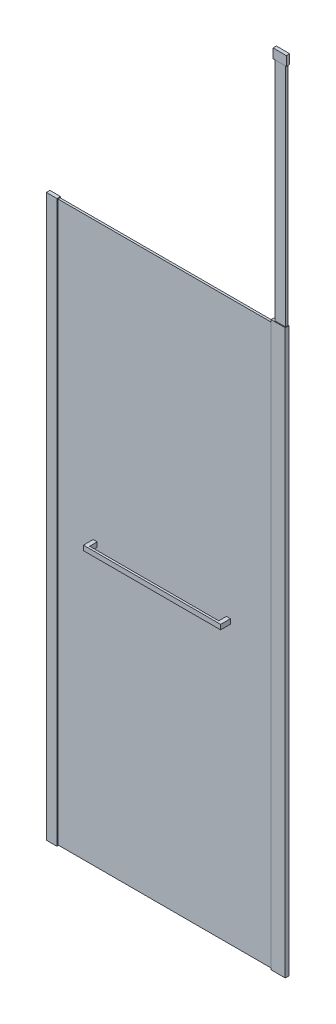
ISO-10303-21;
HEADER;
FILE_DESCRIPTION(('STEP AP214'),'2;1');
FILE_NAME('part.step','',(''),(''),'','','');
FILE_SCHEMA(('AUTOMOTIVE_DESIGN { 1 0 10303 214 1 1 1 1 }'));
ENDSEC;
DATA;
#1=APPLICATION_CONTEXT('core data for automotive mechanical design processes');
#2=APPLICATION_PROTOCOL_DEFINITION('international standard','automotive_design',2000,#1);
#3=PRODUCT_CONTEXT('',#1,'mechanical');
#4=PRODUCT('Part','Part','',(#3));
#5=PRODUCT_RELATED_PRODUCT_CATEGORY('part','',(#4));
#6=PRODUCT_DEFINITION_FORMATION('','',#4);
#7=PRODUCT_DEFINITION_CONTEXT('part definition',#1,'design');
#8=PRODUCT_DEFINITION('design','',#6,#7);
#9=PRODUCT_DEFINITION_SHAPE('','',#8);
#10=(LENGTH_UNIT() NAMED_UNIT(*) SI_UNIT(.MILLI.,.METRE.));
#11=(NAMED_UNIT(*) PLANE_ANGLE_UNIT() SI_UNIT($,.RADIAN.));
#12=(NAMED_UNIT(*) SI_UNIT($,.STERADIAN.) SOLID_ANGLE_UNIT());
#13=UNCERTAINTY_MEASURE_WITH_UNIT(LENGTH_MEASURE(1.E-05),#10,'distance_accuracy_value','');
#14=(GEOMETRIC_REPRESENTATION_CONTEXT(3) GLOBAL_UNCERTAINTY_ASSIGNED_CONTEXT((#13)) GLOBAL_UNIT_ASSIGNED_CONTEXT((#10,
#11,#12)) REPRESENTATION_CONTEXT('',''));
#15=CARTESIAN_POINT('',(0.,0.,0.));
#16=DIRECTION('',(0.,0.,1.));
#17=DIRECTION('',(1.,0.,0.));
#18=AXIS2_PLACEMENT_3D('',#15,#16,#17);
#19=CARTESIAN_POINT('',(187.5,1062.,-21.4));
#20=DIRECTION('',(1.,0.,0.));
#21=DIRECTION('',(0.,0.,-1.));
#22=AXIS2_PLACEMENT_3D('',#19,#20,#21);
#23=PLANE('',#22);
#24=DIRECTION('',(0.,1.,0.));
#25=VECTOR('',#24,1.);
#26=CARTESIAN_POINT('',(187.5,1062.,25.1));
#27=LINE('',#26,#25);
#28=CARTESIAN_POINT('',(187.5,1044.,25.1));
#29=VERTEX_POINT('',#28);
#30=CARTESIAN_POINT('',(187.5,1062.,25.1));
#31=VERTEX_POINT('',#30);
#32=EDGE_CURVE('E63',#29,#31,#27,.T.);
#33=ORIENTED_EDGE('',*,*,#32,.F.);
#34=DIRECTION('',(0.,0.,1.));
#35=VECTOR('',#34,1.);
#36=CARTESIAN_POINT('',(187.5,1044.,-21.4));
#37=LINE('',#36,#35);
#38=CARTESIAN_POINT('',(187.5,1044.,-21.4));
#39=VERTEX_POINT('',#38);
#40=EDGE_CURVE('E12',#39,#29,#37,.T.);
#41=ORIENTED_EDGE('',*,*,#40,.F.);
#42=DIRECTION('',(0.,1.,0.));
#43=VECTOR('',#42,1.);
#44=CARTESIAN_POINT('',(187.5,1062.,-21.4));
#45=LINE('',#44,#43);
#46=CARTESIAN_POINT('',(187.5,1062.,-21.4));
#47=VERTEX_POINT('',#46);
#48=EDGE_CURVE('E193',#39,#47,#45,.T.);
#49=ORIENTED_EDGE('',*,*,#48,.T.);
#50=DIRECTION('',(0.,0.,1.));
#51=VECTOR('',#50,1.);
#52=CARTESIAN_POINT('',(187.5,1062.,-21.4));
#53=LINE('',#52,#51);
#54=EDGE_CURVE('E176',#47,#31,#53,.T.);
#55=ORIENTED_EDGE('',*,*,#54,.T.);
#56=EDGE_LOOP('',(#33,#41,#49,#55));
#57=FACE_BOUND('',#56,.T.);
#58=ADVANCED_FACE('F46',(#57),#23,.T.);
#59=CARTESIAN_POINT('',(172.5,1044.,-21.4));
#60=DIRECTION('',(0.,-1.,0.));
#61=DIRECTION('',(0.,0.,-1.));
#62=AXIS2_PLACEMENT_3D('',#59,#60,#61);
#63=PLANE('',#62);
#64=ORIENTED_EDGE('',*,*,#40,.T.);
#65=DIRECTION('',(-1.,0.,0.));
#66=VECTOR('',#65,1.);
#67=CARTESIAN_POINT('',(692.197715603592,1044.,25.1));
#68=LINE('',#67,#66);
#69=CARTESIAN_POINT('',(672.5,1044.,25.1));
#70=VERTEX_POINT('',#69);
#71=EDGE_CURVE('E166',#70,#29,#68,.T.);
#72=ORIENTED_EDGE('',*,*,#71,.F.);
#73=DIRECTION('',(0.,0.,1.));
#74=VECTOR('',#73,1.);
#75=CARTESIAN_POINT('',(672.5,1044.,-21.4));
#76=LINE('',#75,#74);
#77=CARTESIAN_POINT('',(672.5,1044.,-21.4));
#78=VERTEX_POINT('',#77);
#79=EDGE_CURVE('E149',#78,#70,#76,.T.);
#80=ORIENTED_EDGE('',*,*,#79,.F.);
#81=DIRECTION('',(1.,0.,0.));
#82=VECTOR('',#81,1.);
#83=CARTESIAN_POINT('',(672.5,1044.,-21.4));
#84=LINE('',#83,#82);
#85=CARTESIAN_POINT('',(687.5,1044.,-21.4));
#86=VERTEX_POINT('',#85);
#87=EDGE_CURVE('E131',#78,#86,#84,.T.);
#88=ORIENTED_EDGE('',*,*,#87,.T.);
#89=DIRECTION('',(0.,0.,1.));
#90=VECTOR('',#89,1.);
#91=CARTESIAN_POINT('',(687.5,1044.,-21.4));
#92=LINE('',#91,#90);
#93=CARTESIAN_POINT('',(687.5,1044.,33.1));
#94=VERTEX_POINT('',#93);
#95=EDGE_CURVE('E147',#86,#94,#92,.T.);
#96=ORIENTED_EDGE('',*,*,#95,.T.);
#97=DIRECTION('',(1.,0.,0.));
#98=VECTOR('',#97,1.);
#99=CARTESIAN_POINT('',(172.5,1044.,33.1));
#100=LINE('',#99,#98);
#101=CARTESIAN_POINT('',(172.5,1044.,33.1));
#102=VERTEX_POINT('',#101);
#103=EDGE_CURVE('E135',#102,#94,#100,.T.);
#104=ORIENTED_EDGE('',*,*,#103,.F.);
#105=DIRECTION('',(0.,0.,1.));
#106=VECTOR('',#105,1.);
#107=CARTESIAN_POINT('',(172.5,1044.,-21.4));
#108=LINE('',#107,#106);
#109=CARTESIAN_POINT('',(172.5,1044.,-21.4));
#110=VERTEX_POINT('',#109);
#111=EDGE_CURVE('E55',#110,#102,#108,.T.);
#112=ORIENTED_EDGE('',*,*,#111,.F.);
#113=DIRECTION('',(1.,0.,0.));
#114=VECTOR('',#113,1.);
#115=CARTESIAN_POINT('',(172.5,1044.,-21.4));
#116=LINE('',#115,#114);
#117=EDGE_CURVE('E181',#110,#39,#116,.T.);
#118=ORIENTED_EDGE('',*,*,#117,.T.);
#119=EDGE_LOOP('',(#64,#72,#80,#88,#96,#104,#112,#118));
#120=FACE_BOUND('',#119,.T.);
#121=ADVANCED_FACE('F197',(#120),#63,.T.);
#122=CARTESIAN_POINT('',(172.5,1062.,-21.4));
#123=DIRECTION('',(-1.,0.,0.));
#124=DIRECTION('',(0.,0.,1.));
#125=AXIS2_PLACEMENT_3D('',#122,#123,#124);
#126=PLANE('',#125);
#127=ORIENTED_EDGE('',*,*,#111,.T.);
#128=DIRECTION('',(0.,-1.,0.));
#129=VECTOR('',#128,1.);
#130=CARTESIAN_POINT('',(172.5,1062.,33.1));
#131=LINE('',#130,#129);
#132=CARTESIAN_POINT('',(172.5,1062.,33.1));
#133=VERTEX_POINT('',#132);
#134=EDGE_CURVE('E121',#133,#102,#131,.T.);
#135=ORIENTED_EDGE('',*,*,#134,.F.);
#136=DIRECTION('',(0.,0.,1.));
#137=VECTOR('',#136,1.);
#138=CARTESIAN_POINT('',(172.5,1062.,-21.4));
#139=LINE('',#138,#137);
#140=CARTESIAN_POINT('',(172.5,1062.,-21.4));
#141=VERTEX_POINT('',#140);
#142=EDGE_CURVE('E116',#141,#133,#139,.T.);
#143=ORIENTED_EDGE('',*,*,#142,.F.);
#144=DIRECTION('',(0.,-1.,0.));
#145=VECTOR('',#144,1.);
#146=CARTESIAN_POINT('',(172.5,1062.,-21.4));
#147=LINE('',#146,#145);
#148=EDGE_CURVE('E186',#141,#110,#147,.T.);
#149=ORIENTED_EDGE('',*,*,#148,.T.);
#150=EDGE_LOOP('',(#127,#135,#143,#149));
#151=FACE_BOUND('',#150,.T.);
#152=ADVANCED_FACE('F218',(#151),#126,.T.);
#153=CARTESIAN_POINT('',(172.5,1062.,-21.4));
#154=DIRECTION('',(0.,1.,0.));
#155=DIRECTION('',(0.,0.,1.));
#156=AXIS2_PLACEMENT_3D('',#153,#154,#155);
#157=PLANE('',#156);
#158=ORIENTED_EDGE('',*,*,#142,.T.);
#159=DIRECTION('',(-1.,0.,0.));
#160=VECTOR('',#159,1.);
#161=CARTESIAN_POINT('',(172.5,1062.,33.1));
#162=LINE('',#161,#160);
#163=CARTESIAN_POINT('',(687.5,1062.,33.1));
#164=VERTEX_POINT('',#163);
#165=EDGE_CURVE('E109',#164,#133,#162,.T.);
#166=ORIENTED_EDGE('',*,*,#165,.F.);
#167=DIRECTION('',(0.,0.,1.));
#168=VECTOR('',#167,1.);
#169=CARTESIAN_POINT('',(687.5,1062.,-21.4));
#170=LINE('',#169,#168);
#171=CARTESIAN_POINT('',(687.5,1062.,-21.4));
#172=VERTEX_POINT('',#171);
#173=EDGE_CURVE('E113',#172,#164,#170,.T.);
#174=ORIENTED_EDGE('',*,*,#173,.F.);
#175=DIRECTION('',(-1.,0.,0.));
#176=VECTOR('',#175,1.);
#177=CARTESIAN_POINT('',(672.5,1062.,-21.4));
#178=LINE('',#177,#176);
#179=CARTESIAN_POINT('',(672.5,1062.,-21.4));
#180=VERTEX_POINT('',#179);
#181=EDGE_CURVE('E138',#172,#180,#178,.T.);
#182=ORIENTED_EDGE('',*,*,#181,.T.);
#183=DIRECTION('',(0.,0.,1.));
#184=VECTOR('',#183,1.);
#185=CARTESIAN_POINT('',(672.5,1062.,-21.4));
#186=LINE('',#185,#184);
#187=CARTESIAN_POINT('',(672.5,1062.,25.1));
#188=VERTEX_POINT('',#187);
#189=EDGE_CURVE('E130',#180,#188,#186,.T.);
#190=ORIENTED_EDGE('',*,*,#189,.T.);
#191=DIRECTION('',(-1.,0.,0.));
#192=VECTOR('',#191,1.);
#193=CARTESIAN_POINT('',(692.197715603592,1062.,25.1));
#194=LINE('',#193,#192);
#195=EDGE_CURVE('E163',#188,#31,#194,.T.);
#196=ORIENTED_EDGE('',*,*,#195,.T.);
#197=ORIENTED_EDGE('',*,*,#54,.F.);
#198=DIRECTION('',(-1.,0.,0.));
#199=VECTOR('',#198,1.);
#200=CARTESIAN_POINT('',(172.5,1062.,-21.4));
#201=LINE('',#200,#199);
#202=EDGE_CURVE('E190',#47,#141,#201,.T.);
#203=ORIENTED_EDGE('',*,*,#202,.T.);
#204=EDGE_LOOP('',(#158,#166,#174,#182,#190,#196,#197,#203));
#205=FACE_BOUND('',#204,.T.);
#206=ADVANCED_FACE('F111',(#205),#157,.T.);
#207=CARTESIAN_POINT('',(187.5,1044.,-21.4));
#208=DIRECTION('',(0.,0.,1.));
#209=DIRECTION('',(1.,0.,0.));
#210=AXIS2_PLACEMENT_3D('',#207,#208,#209);
#211=PLANE('',#210);
#212=ORIENTED_EDGE('',*,*,#48,.F.);
#213=ORIENTED_EDGE('',*,*,#117,.F.);
#214=ORIENTED_EDGE('',*,*,#148,.F.);
#215=ORIENTED_EDGE('',*,*,#202,.F.);
#216=EDGE_LOOP('',(#212,#213,#214,#215));
#217=FACE_BOUND('',#216,.T.);
#218=ADVANCED_FACE('F225',(#217),#211,.F.);
#219=CARTESIAN_POINT('',(187.5,1044.,33.1));
#220=DIRECTION('',(0.,0.,1.));
#221=DIRECTION('',(1.,0.,0.));
#222=AXIS2_PLACEMENT_3D('',#219,#220,#221);
#223=PLANE('',#222);
#224=ORIENTED_EDGE('',*,*,#103,.T.);
#225=DIRECTION('',(0.,1.,0.));
#226=VECTOR('',#225,1.);
#227=CARTESIAN_POINT('',(687.5,1062.,33.1));
#228=LINE('',#227,#226);
#229=EDGE_CURVE('E127',#94,#164,#228,.T.);
#230=ORIENTED_EDGE('',*,*,#229,.T.);
#231=ORIENTED_EDGE('',*,*,#165,.T.);
#232=ORIENTED_EDGE('',*,*,#134,.T.);
#233=EDGE_LOOP('',(#224,#230,#231,#232));
#234=FACE_BOUND('',#233,.T.);
#235=ADVANCED_FACE('F133',(#234),#223,.T.);
#236=CARTESIAN_POINT('',(692.197715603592,1062.,25.1));
#237=DIRECTION('',(0.,0.,1.));
#238=DIRECTION('',(1.,0.,0.));
#239=AXIS2_PLACEMENT_3D('',#236,#237,#238);
#240=PLANE('',#239);
#241=ORIENTED_EDGE('',*,*,#195,.F.);
#242=DIRECTION('',(0.,-1.,0.));
#243=VECTOR('',#242,1.);
#244=CARTESIAN_POINT('',(672.5,1062.,25.1));
#245=LINE('',#244,#243);
#246=EDGE_CURVE('E49',#188,#70,#245,.T.);
#247=ORIENTED_EDGE('',*,*,#246,.T.);
#248=ORIENTED_EDGE('',*,*,#71,.T.);
#249=ORIENTED_EDGE('',*,*,#32,.T.);
#250=EDGE_LOOP('',(#241,#247,#248,#249));
#251=FACE_BOUND('',#250,.T.);
#252=ADVANCED_FACE('F203',(#251),#240,.F.);
#253=CARTESIAN_POINT('',(672.5,1062.,-21.4));
#254=DIRECTION('',(-1.,0.,0.));
#255=DIRECTION('',(0.,0.,1.));
#256=AXIS2_PLACEMENT_3D('',#253,#254,#255);
#257=PLANE('',#256);
#258=ORIENTED_EDGE('',*,*,#246,.F.);
#259=ORIENTED_EDGE('',*,*,#189,.F.);
#260=DIRECTION('',(0.,-1.,0.));
#261=VECTOR('',#260,1.);
#262=CARTESIAN_POINT('',(672.5,1062.,-21.4));
#263=LINE('',#262,#261);
#264=EDGE_CURVE('E142',#180,#78,#263,.T.);
#265=ORIENTED_EDGE('',*,*,#264,.T.);
#266=ORIENTED_EDGE('',*,*,#79,.T.);
#267=EDGE_LOOP('',(#258,#259,#265,#266));
#268=FACE_BOUND('',#267,.T.);
#269=ADVANCED_FACE('F204',(#268),#257,.T.);
#270=CARTESIAN_POINT('',(687.5,1062.,-21.4));
#271=DIRECTION('',(1.,0.,0.));
#272=DIRECTION('',(0.,0.,-1.));
#273=AXIS2_PLACEMENT_3D('',#270,#271,#272);
#274=PLANE('',#273);
#275=ORIENTED_EDGE('',*,*,#173,.T.);
#276=ORIENTED_EDGE('',*,*,#229,.F.);
#277=ORIENTED_EDGE('',*,*,#95,.F.);
#278=DIRECTION('',(0.,1.,0.));
#279=VECTOR('',#278,1.);
#280=CARTESIAN_POINT('',(687.5,1062.,-21.4));
#281=LINE('',#280,#279);
#282=EDGE_CURVE('E129',#86,#172,#281,.T.);
#283=ORIENTED_EDGE('',*,*,#282,.T.);
#284=EDGE_LOOP('',(#275,#276,#277,#283));
#285=FACE_BOUND('',#284,.T.);
#286=ADVANCED_FACE('F126',(#285),#274,.T.);
#287=CARTESIAN_POINT('',(687.5,1044.,-21.4));
#288=DIRECTION('',(0.,0.,1.));
#289=DIRECTION('',(1.,0.,0.));
#290=AXIS2_PLACEMENT_3D('',#287,#288,#289);
#291=PLANE('',#290);
#292=ORIENTED_EDGE('',*,*,#282,.F.);
#293=ORIENTED_EDGE('',*,*,#87,.F.);
#294=ORIENTED_EDGE('',*,*,#264,.F.);
#295=ORIENTED_EDGE('',*,*,#181,.F.);
#296=EDGE_LOOP('',(#292,#293,#294,#295));
#297=FACE_BOUND('',#296,.T.);
#298=ADVANCED_FACE('F200',(#297),#291,.F.);
#299=CLOSED_SHELL('',(#58,#121,#152,#206,#218,#235,#252,#269,#286,#298));
#300=MANIFOLD_SOLID_BREP('B2',#299);
#301=CARTESIAN_POINT('',(849.9,3000.,-1.15000000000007));
#302=DIRECTION('',(1.,0.,0.));
#303=DIRECTION('',(0.,1.,0.));
#304=AXIS2_PLACEMENT_3D('',#301,#302,#303);
#305=PLANE('',#304);
#306=DIRECTION('',(0.,0.,1.));
#307=VECTOR('',#306,1.);
#308=CARTESIAN_POINT('',(849.9,2965.,-1.15000000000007));
#309=LINE('',#308,#307);
#310=CARTESIAN_POINT('',(849.9,2965.,-13.6500000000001));
#311=VERTEX_POINT('',#310);
#312=CARTESIAN_POINT('',(849.9,2965.,-1.15000000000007));
#313=VERTEX_POINT('',#312);
#314=EDGE_CURVE('E406',#311,#313,#309,.T.);
#315=ORIENTED_EDGE('',*,*,#314,.T.);
#316=DIRECTION('',(0.,-1.,0.));
#317=VECTOR('',#316,1.);
#318=CARTESIAN_POINT('',(849.9,3000.,-1.15000000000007));
#319=LINE('',#318,#317);
#320=CARTESIAN_POINT('',(849.9,3000.,-1.15000000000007));
#321=VERTEX_POINT('',#320);
#322=EDGE_CURVE('E387',#321,#313,#319,.T.);
#323=ORIENTED_EDGE('',*,*,#322,.F.);
#324=DIRECTION('',(0.,0.,1.));
#325=VECTOR('',#324,1.);
#326=CARTESIAN_POINT('',(849.9,3000.,-1.15000000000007));
#327=LINE('',#326,#325);
#328=CARTESIAN_POINT('',(849.9,3000.,-13.6500000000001));
#329=VERTEX_POINT('',#328);
#330=EDGE_CURVE('E394',#329,#321,#327,.T.);
#331=ORIENTED_EDGE('',*,*,#330,.F.);
#332=DIRECTION('',(0.,-1.,0.));
#333=VECTOR('',#332,1.);
#334=CARTESIAN_POINT('',(849.9,3000.,-13.6500000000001));
#335=LINE('',#334,#333);
#336=EDGE_CURVE('E545',#329,#311,#335,.T.);
#337=ORIENTED_EDGE('',*,*,#336,.T.);
#338=EDGE_LOOP('',(#315,#323,#331,#337));
#339=FACE_BOUND('',#338,.T.);
#340=ADVANCED_FACE('F318',(#339),#305,.F.);
#341=CARTESIAN_POINT('',(899.9,3000.,-1.15000000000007));
#342=DIRECTION('',(0.,0.,-1.));
#343=DIRECTION('',(-1.,0.,0.));
#344=AXIS2_PLACEMENT_3D('',#341,#342,#343);
#345=PLANE('',#344);
#346=DIRECTION('',(1.,0.,0.));
#347=VECTOR('',#346,1.);
#348=CARTESIAN_POINT('',(899.9,2965.,-1.15000000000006));
#349=LINE('',#348,#347);
#350=CARTESIAN_POINT('',(899.9,2965.,-1.15000000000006));
#351=VERTEX_POINT('',#350);
#352=EDGE_CURVE('E543',#313,#351,#349,.T.);
#353=ORIENTED_EDGE('',*,*,#352,.T.);
#354=DIRECTION('',(0.,-1.,0.));
#355=VECTOR('',#354,1.);
#356=CARTESIAN_POINT('',(899.9,3000.,-1.15000000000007));
#357=LINE('',#356,#355);
#358=CARTESIAN_POINT('',(899.9,3000.,-1.15000000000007));
#359=VERTEX_POINT('',#358);
#360=EDGE_CURVE('E390',#359,#351,#357,.T.);
#361=ORIENTED_EDGE('',*,*,#360,.F.);
#362=DIRECTION('',(1.,0.,0.));
#363=VECTOR('',#362,1.);
#364=CARTESIAN_POINT('',(899.9,3000.,-1.15000000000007));
#365=LINE('',#364,#363);
#366=EDGE_CURVE('E383',#321,#359,#365,.T.);
#367=ORIENTED_EDGE('',*,*,#366,.F.);
#368=ORIENTED_EDGE('',*,*,#322,.T.);
#369=EDGE_LOOP('',(#353,#361,#367,#368));
#370=FACE_BOUND('',#369,.T.);
#371=ADVANCED_FACE('F385',(#370),#345,.F.);
#372=CARTESIAN_POINT('',(899.9,3000.,-1.15000000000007));
#373=DIRECTION('',(-1.,0.,0.));
#374=DIRECTION('',(0.,-1.,0.));
#375=AXIS2_PLACEMENT_3D('',#372,#373,#374);
#376=PLANE('',#375);
#377=DIRECTION('',(0.,0.,-1.));
#378=VECTOR('',#377,1.);
#379=CARTESIAN_POINT('',(899.9,2965.,-1.15000000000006));
#380=LINE('',#379,#378);
#381=CARTESIAN_POINT('',(899.9,2965.,-13.6500000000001));
#382=VERTEX_POINT('',#381);
#383=EDGE_CURVE('E539',#351,#382,#380,.T.);
#384=ORIENTED_EDGE('',*,*,#383,.T.);
#385=DIRECTION('',(0.,-1.,0.));
#386=VECTOR('',#385,1.);
#387=CARTESIAN_POINT('',(899.9,3000.,-13.6500000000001));
#388=LINE('',#387,#386);
#389=CARTESIAN_POINT('',(899.9,3000.,-13.6500000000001));
#390=VERTEX_POINT('',#389);
#391=EDGE_CURVE('E410',#390,#382,#388,.T.);
#392=ORIENTED_EDGE('',*,*,#391,.F.);
#393=DIRECTION('',(0.,0.,-1.));
#394=VECTOR('',#393,1.);
#395=CARTESIAN_POINT('',(899.9,3000.,-1.15000000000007));
#396=LINE('',#395,#394);
#397=EDGE_CURVE('E393',#359,#390,#396,.T.);
#398=ORIENTED_EDGE('',*,*,#397,.F.);
#399=ORIENTED_EDGE('',*,*,#360,.T.);
#400=EDGE_LOOP('',(#384,#392,#398,#399));
#401=FACE_BOUND('',#400,.T.);
#402=ADVANCED_FACE('F460',(#401),#376,.F.);
#403=CARTESIAN_POINT('',(899.9,3000.,-13.6500000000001));
#404=DIRECTION('',(0.,0.,1.));
#405=DIRECTION('',(1.,0.,0.));
#406=AXIS2_PLACEMENT_3D('',#403,#404,#405);
#407=PLANE('',#406);
#408=DIRECTION('',(-1.,0.,0.));
#409=VECTOR('',#408,1.);
#410=CARTESIAN_POINT('',(899.9,2965.,-13.6500000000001));
#411=LINE('',#410,#409);
#412=EDGE_CURVE('E403',#382,#311,#411,.T.);
#413=ORIENTED_EDGE('',*,*,#412,.T.);
#414=ORIENTED_EDGE('',*,*,#336,.F.);
#415=DIRECTION('',(-1.,0.,0.));
#416=VECTOR('',#415,1.);
#417=CARTESIAN_POINT('',(899.9,3000.,-13.6500000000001));
#418=LINE('',#417,#416);
#419=EDGE_CURVE('E399',#390,#329,#418,.T.);
#420=ORIENTED_EDGE('',*,*,#419,.F.);
#421=ORIENTED_EDGE('',*,*,#391,.T.);
#422=EDGE_LOOP('',(#413,#414,#420,#421));
#423=FACE_BOUND('',#422,.T.);
#424=ADVANCED_FACE('F507',(#423),#407,.F.);
#425=CARTESIAN_POINT('',(849.9,3000.,-13.6500000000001));
#426=DIRECTION('',(0.,1.,0.));
#427=DIRECTION('',(0.,0.,1.));
#428=AXIS2_PLACEMENT_3D('',#425,#426,#427);
#429=PLANE('',#428);
#430=ORIENTED_EDGE('',*,*,#330,.T.);
#431=ORIENTED_EDGE('',*,*,#366,.T.);
#432=ORIENTED_EDGE('',*,*,#397,.T.);
#433=ORIENTED_EDGE('',*,*,#419,.T.);
#434=EDGE_LOOP('',(#430,#431,#432,#433));
#435=FACE_BOUND('',#434,.T.);
#436=ADVANCED_FACE('F397',(#435),#429,.T.);
#437=CARTESIAN_POINT('',(849.9,2965.,-13.6500000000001));
#438=DIRECTION('',(0.,1.,0.));
#439=DIRECTION('',(0.,0.,1.));
#440=AXIS2_PLACEMENT_3D('',#437,#438,#439);
#441=PLANE('',#440);
#442=DIRECTION('',(0.,0.,1.));
#443=VECTOR('',#442,1.);
#444=CARTESIAN_POINT('',(894.9,2965.,-11.4000000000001));
#445=LINE('',#444,#443);
#446=CARTESIAN_POINT('',(894.9,2965.,-11.4000000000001));
#447=VERTEX_POINT('',#446);
#448=CARTESIAN_POINT('',(894.9,2965.,-3.40000000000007));
#449=VERTEX_POINT('',#448);
#450=EDGE_CURVE('E415',#447,#449,#445,.T.);
#451=ORIENTED_EDGE('',*,*,#450,.F.);
#452=DIRECTION('',(1.,0.,0.));
#453=VECTOR('',#452,1.);
#454=CARTESIAN_POINT('',(894.9,2965.,-11.4000000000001));
#455=LINE('',#454,#453);
#456=CARTESIAN_POINT('',(854.9,2965.,-11.4000000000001));
#457=VERTEX_POINT('',#456);
#458=EDGE_CURVE('E408',#457,#447,#455,.T.);
#459=ORIENTED_EDGE('',*,*,#458,.F.);
#460=DIRECTION('',(0.,0.,-1.));
#461=VECTOR('',#460,1.);
#462=CARTESIAN_POINT('',(854.9,2965.,-11.4000000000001));
#463=LINE('',#462,#461);
#464=CARTESIAN_POINT('',(854.9,2965.,-3.40000000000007));
#465=VERTEX_POINT('',#464);
#466=EDGE_CURVE('E333',#465,#457,#463,.T.);
#467=ORIENTED_EDGE('',*,*,#466,.F.);
#468=DIRECTION('',(-1.,0.,0.));
#469=VECTOR('',#468,1.);
#470=CARTESIAN_POINT('',(894.9,2965.,-3.40000000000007));
#471=LINE('',#470,#469);
#472=EDGE_CURVE('E44',#449,#465,#471,.T.);
#473=ORIENTED_EDGE('',*,*,#472,.F.);
#474=EDGE_LOOP('',(#451,#459,#467,#473));
#475=FACE_BOUND('',#474,.T.);
#476=ORIENTED_EDGE('',*,*,#314,.F.);
#477=ORIENTED_EDGE('',*,*,#412,.F.);
#478=ORIENTED_EDGE('',*,*,#383,.F.);
#479=ORIENTED_EDGE('',*,*,#352,.F.);
#480=EDGE_LOOP('',(#476,#477,#478,#479));
#481=FACE_BOUND('',#480,.T.);
#482=ADVANCED_FACE('F490',(#475,#481),#441,.F.);
#483=CARTESIAN_POINT('',(894.9,2997.,-11.4000000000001));
#484=DIRECTION('',(1.,0.,0.));
#485=DIRECTION('',(0.,0.,-1.));
#486=AXIS2_PLACEMENT_3D('',#483,#484,#485);
#487=PLANE('',#486);
#488=DIRECTION('',(0.,-1.,0.));
#489=VECTOR('',#488,1.);
#490=CARTESIAN_POINT('',(894.9,2997.,-11.4000000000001));
#491=LINE('',#490,#489);
#492=CARTESIAN_POINT('',(894.9,2114.,-11.4000000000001));
#493=VERTEX_POINT('',#492);
#494=EDGE_CURVE('E326',#447,#493,#491,.T.);
#495=ORIENTED_EDGE('',*,*,#494,.F.);
#496=ORIENTED_EDGE('',*,*,#450,.T.);
#497=DIRECTION('',(0.,-1.,0.));
#498=VECTOR('',#497,1.);
#499=CARTESIAN_POINT('',(894.9,2997.,-3.40000000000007));
#500=LINE('',#499,#498);
#501=CARTESIAN_POINT('',(894.9,2114.,-3.40000000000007));
#502=VERTEX_POINT('',#501);
#503=EDGE_CURVE('E430',#449,#502,#500,.T.);
#504=ORIENTED_EDGE('',*,*,#503,.T.);
#505=DIRECTION('',(0.,0.,1.));
#506=VECTOR('',#505,1.);
#507=CARTESIAN_POINT('',(894.9,2114.,-11.4000000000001));
#508=LINE('',#507,#506);
#509=EDGE_CURVE('E418',#493,#502,#508,.T.);
#510=ORIENTED_EDGE('',*,*,#509,.F.);
#511=EDGE_LOOP('',(#495,#496,#504,#510));
#512=FACE_BOUND('',#511,.T.);
#513=ADVANCED_FACE('F320',(#512),#487,.T.);
#514=CARTESIAN_POINT('',(894.9,2997.,-11.4000000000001));
#515=DIRECTION('',(0.,0.,-1.));
#516=DIRECTION('',(-1.,0.,0.));
#517=AXIS2_PLACEMENT_3D('',#514,#515,#516);
#518=PLANE('',#517);
#519=DIRECTION('',(0.,-1.,0.));
#520=VECTOR('',#519,1.);
#521=CARTESIAN_POINT('',(854.9,2997.,-11.4000000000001));
#522=LINE('',#521,#520);
#523=CARTESIAN_POINT('',(854.9,2114.,-11.4000000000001));
#524=VERTEX_POINT('',#523);
#525=EDGE_CURVE('E432',#457,#524,#522,.T.);
#526=ORIENTED_EDGE('',*,*,#525,.F.);
#527=ORIENTED_EDGE('',*,*,#458,.T.);
#528=ORIENTED_EDGE('',*,*,#494,.T.);
#529=DIRECTION('',(1.,0.,0.));
#530=VECTOR('',#529,1.);
#531=CARTESIAN_POINT('',(894.9,2114.,-11.4000000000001));
#532=LINE('',#531,#530);
#533=EDGE_CURVE('E427',#524,#493,#532,.T.);
#534=ORIENTED_EDGE('',*,*,#533,.F.);
#535=EDGE_LOOP('',(#526,#527,#528,#534));
#536=FACE_BOUND('',#535,.T.);
#537=ADVANCED_FACE('F445',(#536),#518,.T.);
#538=CARTESIAN_POINT('',(854.9,2997.,-11.4000000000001));
#539=DIRECTION('',(-1.,0.,0.));
#540=DIRECTION('',(0.,0.,1.));
#541=AXIS2_PLACEMENT_3D('',#538,#539,#540);
#542=PLANE('',#541);
#543=DIRECTION('',(0.,-1.,0.));
#544=VECTOR('',#543,1.);
#545=CARTESIAN_POINT('',(854.9,2997.,-3.40000000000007));
#546=LINE('',#545,#544);
#547=CARTESIAN_POINT('',(854.9,2114.,-3.40000000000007));
#548=VERTEX_POINT('',#547);
#549=EDGE_CURVE('E434',#465,#548,#546,.T.);
#550=ORIENTED_EDGE('',*,*,#549,.F.);
#551=ORIENTED_EDGE('',*,*,#466,.T.);
#552=ORIENTED_EDGE('',*,*,#525,.T.);
#553=DIRECTION('',(0.,0.,-1.));
#554=VECTOR('',#553,1.);
#555=CARTESIAN_POINT('',(854.9,2114.,-11.4000000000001));
#556=LINE('',#555,#554);
#557=EDGE_CURVE('E424',#548,#524,#556,.T.);
#558=ORIENTED_EDGE('',*,*,#557,.F.);
#559=EDGE_LOOP('',(#550,#551,#552,#558));
#560=FACE_BOUND('',#559,.T.);
#561=ADVANCED_FACE('F447',(#560),#542,.T.);
#562=CARTESIAN_POINT('',(894.9,2997.,-3.40000000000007));
#563=DIRECTION('',(0.,0.,1.));
#564=DIRECTION('',(1.,0.,0.));
#565=AXIS2_PLACEMENT_3D('',#562,#563,#564);
#566=PLANE('',#565);
#567=ORIENTED_EDGE('',*,*,#503,.F.);
#568=ORIENTED_EDGE('',*,*,#472,.T.);
#569=ORIENTED_EDGE('',*,*,#549,.T.);
#570=DIRECTION('',(-1.,0.,0.));
#571=VECTOR('',#570,1.);
#572=CARTESIAN_POINT('',(894.9,2114.,-3.40000000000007));
#573=LINE('',#572,#571);
#574=EDGE_CURVE('E421',#502,#548,#573,.T.);
#575=ORIENTED_EDGE('',*,*,#574,.F.);
#576=EDGE_LOOP('',(#567,#568,#569,#575));
#577=FACE_BOUND('',#576,.T.);
#578=ADVANCED_FACE('F439',(#577),#566,.T.);
#579=CARTESIAN_POINT('',(894.9,2114.,-3.40000000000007));
#580=DIRECTION('',(0.,-1.,0.));
#581=DIRECTION('',(0.,0.,-1.));
#582=AXIS2_PLACEMENT_3D('',#579,#580,#581);
#583=PLANE('',#582);
#584=ORIENTED_EDGE('',*,*,#509,.T.);
#585=ORIENTED_EDGE('',*,*,#574,.T.);
#586=ORIENTED_EDGE('',*,*,#557,.T.);
#587=ORIENTED_EDGE('',*,*,#533,.T.);
#588=EDGE_LOOP('',(#584,#585,#586,#587));
#589=FACE_BOUND('',#588,.T.);
#590=ADVANCED_FACE('F443',(#589),#583,.T.);
#591=CLOSED_SHELL('',(#340,#371,#402,#424,#436,#482,#513,#537,#561,#578,#590));
#592=MANIFOLD_SOLID_BREP('B6',#591);
#593=CARTESIAN_POINT('',(853.5,2111.,-3.39999999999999));
#594=DIRECTION('',(0.,0.,-1.));
#595=DIRECTION('',(-1.,0.,0.));
#596=AXIS2_PLACEMENT_3D('',#593,#594,#595);
#597=PLANE('',#596);
#598=DIRECTION('',(-1.,0.,0.));
#599=VECTOR('',#598,1.);
#600=CARTESIAN_POINT('',(853.5,2103.2,-3.39999999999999));
#601=LINE('',#600,#599);
#602=CARTESIAN_POINT('',(853.5,2103.2,-3.39999999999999));
#603=VERTEX_POINT('',#602);
#604=CARTESIAN_POINT('',(843.4,2103.2,-3.39999999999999));
#605=VERTEX_POINT('',#604);
#606=EDGE_CURVE('E672',#603,#605,#601,.T.);
#607=ORIENTED_EDGE('',*,*,#606,.F.);
#608=DIRECTION('',(0.,-1.,0.));
#609=VECTOR('',#608,1.);
#610=CARTESIAN_POINT('',(853.5,2111.,-3.39999999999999));
#611=LINE('',#610,#609);
#612=CARTESIAN_POINT('',(853.5,3.,-3.39999999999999));
#613=VERTEX_POINT('',#612);
#614=EDGE_CURVE('E695',#603,#613,#611,.T.);
#615=ORIENTED_EDGE('',*,*,#614,.T.);
#616=DIRECTION('',(1.,0.,0.));
#617=VECTOR('',#616,1.);
#618=CARTESIAN_POINT('',(853.5,3.,-3.39999999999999));
#619=LINE('',#618,#617);
#620=CARTESIAN_POINT('',(843.4,3.,-3.39999999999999));
#621=VERTEX_POINT('',#620);
#622=EDGE_CURVE('E683',#621,#613,#619,.T.);
#623=ORIENTED_EDGE('',*,*,#622,.F.);
#624=DIRECTION('',(0.,-1.,0.));
#625=VECTOR('',#624,1.);
#626=CARTESIAN_POINT('',(843.4,2111.,-3.39999999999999));
#627=LINE('',#626,#625);
#628=EDGE_CURVE('E575',#605,#621,#627,.T.);
#629=ORIENTED_EDGE('',*,*,#628,.F.);
#630=EDGE_LOOP('',(#607,#615,#623,#629));
#631=FACE_BOUND('',#630,.T.);
#632=ADVANCED_FACE('F567',(#631),#597,.T.);
#633=CARTESIAN_POINT('',(843.4,2111.,-3.39999999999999));
#634=DIRECTION('',(-1.,0.,0.));
#635=DIRECTION('',(0.,0.,1.));
#636=AXIS2_PLACEMENT_3D('',#633,#634,#635);
#637=PLANE('',#636);
#638=DIRECTION('',(0.,-1.,0.));
#639=VECTOR('',#638,1.);
#640=CARTESIAN_POINT('',(843.4,2111.,-14.4));
#641=LINE('',#640,#639);
#642=CARTESIAN_POINT('',(843.4,2114.,-14.4));
#643=VERTEX_POINT('',#642);
#644=CARTESIAN_POINT('',(843.4,0.,-14.4));
#645=VERTEX_POINT('',#644);
#646=EDGE_CURVE('E635',#643,#645,#641,.T.);
#647=ORIENTED_EDGE('',*,*,#646,.T.);
#648=DIRECTION('',(0.,0.,-1.));
#649=VECTOR('',#648,1.);
#650=CARTESIAN_POINT('',(843.4,0.,-0.399999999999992));
#651=LINE('',#650,#649);
#652=CARTESIAN_POINT('',(843.4,0.,-0.399999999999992));
#653=VERTEX_POINT('',#652);
#654=EDGE_CURVE('E639',#653,#645,#651,.T.);
#655=ORIENTED_EDGE('',*,*,#654,.F.);
#656=DIRECTION('',(0.,-1.,0.));
#657=VECTOR('',#656,1.);
#658=CARTESIAN_POINT('',(843.4,2111.,-0.399999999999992));
#659=LINE('',#658,#657);
#660=CARTESIAN_POINT('',(843.4,2114.,-0.399999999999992));
#661=VERTEX_POINT('',#660);
#662=EDGE_CURVE('E690',#661,#653,#659,.T.);
#663=ORIENTED_EDGE('',*,*,#662,.F.);
#664=DIRECTION('',(0.,0.,1.));
#665=VECTOR('',#664,1.);
#666=CARTESIAN_POINT('',(843.4,2114.,-14.4));
#667=LINE('',#666,#665);
#668=EDGE_CURVE('E641',#643,#661,#667,.T.);
#669=ORIENTED_EDGE('',*,*,#668,.F.);
#670=EDGE_LOOP('',(#647,#655,#663,#669));
#671=FACE_BOUND('',#670,.T.);
#672=DIRECTION('',(0.,0.,1.));
#673=VECTOR('',#672,1.);
#674=CARTESIAN_POINT('',(843.4,2103.2,-3.34999999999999));
#675=LINE('',#674,#673);
#676=CARTESIAN_POINT('',(843.4,2103.2,-11.4));
#677=VERTEX_POINT('',#676);
#678=EDGE_CURVE('E666',#677,#605,#675,.T.);
#679=ORIENTED_EDGE('',*,*,#678,.T.);
#680=ORIENTED_EDGE('',*,*,#628,.T.);
#681=DIRECTION('',(0.,0.,-1.));
#682=VECTOR('',#681,1.);
#683=CARTESIAN_POINT('',(843.4,3.,-0.399999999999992));
#684=LINE('',#683,#682);
#685=CARTESIAN_POINT('',(843.4,3.,-11.4));
#686=VERTEX_POINT('',#685);
#687=EDGE_CURVE('E660',#621,#686,#684,.T.);
#688=ORIENTED_EDGE('',*,*,#687,.T.);
#689=DIRECTION('',(0.,-1.,0.));
#690=VECTOR('',#689,1.);
#691=CARTESIAN_POINT('',(843.4,2111.,-11.4));
#692=LINE('',#691,#690);
#693=EDGE_CURVE('E646',#677,#686,#692,.T.);
#694=ORIENTED_EDGE('',*,*,#693,.F.);
#695=EDGE_LOOP('',(#679,#680,#688,#694));
#696=FACE_BOUND('',#695,.T.);
#697=ADVANCED_FACE('F637',(#671,#696),#637,.T.);
#698=CARTESIAN_POINT('',(843.4,2111.,-0.399999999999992));
#699=DIRECTION('',(0.,0.,1.));
#700=DIRECTION('',(1.,0.,0.));
#701=AXIS2_PLACEMENT_3D('',#698,#699,#700);
#702=PLANE('',#701);
#703=ORIENTED_EDGE('',*,*,#662,.T.);
#704=DIRECTION('',(-1.,0.,0.));
#705=VECTOR('',#704,1.);
#706=CARTESIAN_POINT('',(843.4,0.,-0.399999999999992));
#707=LINE('',#706,#705);
#708=CARTESIAN_POINT('',(896.4,0.,-0.399999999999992));
#709=VERTEX_POINT('',#708);
#710=EDGE_CURVE('E659',#709,#653,#707,.T.);
#711=ORIENTED_EDGE('',*,*,#710,.F.);
#712=DIRECTION('',(0.,-1.,0.));
#713=VECTOR('',#712,1.);
#714=CARTESIAN_POINT('',(896.4,2111.,-0.399999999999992));
#715=LINE('',#714,#713);
#716=CARTESIAN_POINT('',(896.4,2114.,-0.399999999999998));
#717=VERTEX_POINT('',#716);
#718=EDGE_CURVE('E782',#717,#709,#715,.T.);
#719=ORIENTED_EDGE('',*,*,#718,.F.);
#720=DIRECTION('',(1.,0.,0.));
#721=VECTOR('',#720,1.);
#722=CARTESIAN_POINT('',(896.4,2114.,-0.399999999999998));
#723=LINE('',#722,#721);
#724=EDGE_CURVE('E680',#661,#717,#723,.T.);
#725=ORIENTED_EDGE('',*,*,#724,.F.);
#726=EDGE_LOOP('',(#703,#711,#719,#725));
#727=FACE_BOUND('',#726,.T.);
#728=ADVANCED_FACE('F723',(#727),#702,.T.);
#729=CARTESIAN_POINT('',(896.4,2111.,-0.399999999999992));
#730=DIRECTION('',(1.,0.,0.));
#731=DIRECTION('',(0.,0.,-1.));
#732=AXIS2_PLACEMENT_3D('',#729,#730,#731);
#733=PLANE('',#732);
#734=ORIENTED_EDGE('',*,*,#718,.T.);
#735=DIRECTION('',(0.,0.,1.));
#736=VECTOR('',#735,1.);
#737=CARTESIAN_POINT('',(896.4,0.,-0.399999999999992));
#738=LINE('',#737,#736);
#739=CARTESIAN_POINT('',(896.4,0.,-14.4));
#740=VERTEX_POINT('',#739);
#741=EDGE_CURVE('E654',#740,#709,#738,.T.);
#742=ORIENTED_EDGE('',*,*,#741,.F.);
#743=DIRECTION('',(0.,-1.,0.));
#744=VECTOR('',#743,1.);
#745=CARTESIAN_POINT('',(896.4,2111.,-14.4));
#746=LINE('',#745,#744);
#747=CARTESIAN_POINT('',(896.4,2114.,-14.4));
#748=VERTEX_POINT('',#747);
#749=EDGE_CURVE('E645',#748,#740,#746,.T.);
#750=ORIENTED_EDGE('',*,*,#749,.F.);
#751=DIRECTION('',(0.,0.,-1.));
#752=VECTOR('',#751,1.);
#753=CARTESIAN_POINT('',(896.4,2114.,-14.4));
#754=LINE('',#753,#752);
#755=EDGE_CURVE('E674',#717,#748,#754,.T.);
#756=ORIENTED_EDGE('',*,*,#755,.F.);
#757=EDGE_LOOP('',(#734,#742,#750,#756));
#758=FACE_BOUND('',#757,.T.);
#759=ADVANCED_FACE('F728',(#758),#733,.T.);
#760=CARTESIAN_POINT('',(896.4,2111.,-14.4));
#761=DIRECTION('',(0.,0.,-1.));
#762=DIRECTION('',(-1.,0.,0.));
#763=AXIS2_PLACEMENT_3D('',#760,#761,#762);
#764=PLANE('',#763);
#765=ORIENTED_EDGE('',*,*,#749,.T.);
#766=DIRECTION('',(1.,0.,0.));
#767=VECTOR('',#766,1.);
#768=CARTESIAN_POINT('',(843.4,0.,-14.4));
#769=LINE('',#768,#767);
#770=EDGE_CURVE('E649',#645,#740,#769,.T.);
#771=ORIENTED_EDGE('',*,*,#770,.F.);
#772=ORIENTED_EDGE('',*,*,#646,.F.);
#773=DIRECTION('',(-1.,0.,0.));
#774=VECTOR('',#773,1.);
#775=CARTESIAN_POINT('',(896.4,2114.,-14.4));
#776=LINE('',#775,#774);
#777=EDGE_CURVE('E677',#748,#643,#776,.T.);
#778=ORIENTED_EDGE('',*,*,#777,.F.);
#779=EDGE_LOOP('',(#765,#771,#772,#778));
#780=FACE_BOUND('',#779,.T.);
#781=ADVANCED_FACE('F650',(#780),#764,.T.);
#782=CARTESIAN_POINT('',(843.4,2111.,-11.4));
#783=DIRECTION('',(0.,0.,1.));
#784=DIRECTION('',(1.,0.,0.));
#785=AXIS2_PLACEMENT_3D('',#782,#783,#784);
#786=PLANE('',#785);
#787=DIRECTION('',(1.,0.,0.));
#788=VECTOR('',#787,1.);
#789=CARTESIAN_POINT('',(843.4,2103.2,-11.4));
#790=LINE('',#789,#788);
#791=CARTESIAN_POINT('',(853.5,2103.2,-11.4));
#792=VERTEX_POINT('',#791);
#793=EDGE_CURVE('E670',#677,#792,#790,.T.);
#794=ORIENTED_EDGE('',*,*,#793,.F.);
#795=ORIENTED_EDGE('',*,*,#693,.T.);
#796=DIRECTION('',(-1.,0.,0.));
#797=VECTOR('',#796,1.);
#798=CARTESIAN_POINT('',(843.4,3.,-11.4));
#799=LINE('',#798,#797);
#800=CARTESIAN_POINT('',(853.5,3.,-11.4));
#801=VERTEX_POINT('',#800);
#802=EDGE_CURVE('E687',#801,#686,#799,.T.);
#803=ORIENTED_EDGE('',*,*,#802,.F.);
#804=DIRECTION('',(0.,-1.,0.));
#805=VECTOR('',#804,1.);
#806=CARTESIAN_POINT('',(853.5,2111.,-11.4));
#807=LINE('',#806,#805);
#808=EDGE_CURVE('E590',#792,#801,#807,.T.);
#809=ORIENTED_EDGE('',*,*,#808,.F.);
#810=EDGE_LOOP('',(#794,#795,#803,#809));
#811=FACE_BOUND('',#810,.T.);
#812=ADVANCED_FACE('F709',(#811),#786,.T.);
#813=CARTESIAN_POINT('',(853.5,2111.,-11.4));
#814=DIRECTION('',(-1.,0.,0.));
#815=DIRECTION('',(0.,0.,1.));
#816=AXIS2_PLACEMENT_3D('',#813,#814,#815);
#817=PLANE('',#816);
#818=DIRECTION('',(0.,0.,1.));
#819=VECTOR('',#818,1.);
#820=CARTESIAN_POINT('',(853.5,2103.2,-11.4));
#821=LINE('',#820,#819);
#822=EDGE_CURVE('E316',#792,#603,#821,.T.);
#823=ORIENTED_EDGE('',*,*,#822,.F.);
#824=ORIENTED_EDGE('',*,*,#808,.T.);
#825=DIRECTION('',(0.,0.,-1.));
#826=VECTOR('',#825,1.);
#827=CARTESIAN_POINT('',(853.5,3.,-11.4));
#828=LINE('',#827,#826);
#829=EDGE_CURVE('E684',#613,#801,#828,.T.);
#830=ORIENTED_EDGE('',*,*,#829,.F.);
#831=ORIENTED_EDGE('',*,*,#614,.F.);
#832=EDGE_LOOP('',(#823,#824,#830,#831));
#833=FACE_BOUND('',#832,.T.);
#834=ADVANCED_FACE('F706',(#833),#817,.T.);
#835=CARTESIAN_POINT('',(896.4,2114.,-0.399999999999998));
#836=DIRECTION('',(0.,-1.,0.));
#837=DIRECTION('',(0.,0.,-1.));
#838=AXIS2_PLACEMENT_3D('',#835,#836,#837);
#839=PLANE('',#838);
#840=ORIENTED_EDGE('',*,*,#755,.T.);
#841=ORIENTED_EDGE('',*,*,#777,.T.);
#842=ORIENTED_EDGE('',*,*,#668,.T.);
#843=ORIENTED_EDGE('',*,*,#724,.T.);
#844=EDGE_LOOP('',(#840,#841,#842,#843));
#845=FACE_BOUND('',#844,.T.);
#846=ADVANCED_FACE('F708',(#845),#839,.F.);
#847=CARTESIAN_POINT('',(858.4,2103.2,-3.34999999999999));
#848=DIRECTION('',(0.,-1.,0.));
#849=DIRECTION('',(0.,0.,-1.));
#850=AXIS2_PLACEMENT_3D('',#847,#848,#849);
#851=PLANE('',#850);
#852=ORIENTED_EDGE('',*,*,#822,.T.);
#853=ORIENTED_EDGE('',*,*,#606,.T.);
#854=ORIENTED_EDGE('',*,*,#678,.F.);
#855=ORIENTED_EDGE('',*,*,#793,.T.);
#856=EDGE_LOOP('',(#852,#853,#854,#855));
#857=FACE_BOUND('',#856,.T.);
#858=ADVANCED_FACE('F714',(#857),#851,.T.);
#859=CARTESIAN_POINT('',(843.4,3.,-14.4));
#860=DIRECTION('',(0.,-1.,0.));
#861=DIRECTION('',(0.,0.,-1.));
#862=AXIS2_PLACEMENT_3D('',#859,#860,#861);
#863=PLANE('',#862);
#864=ORIENTED_EDGE('',*,*,#687,.F.);
#865=ORIENTED_EDGE('',*,*,#622,.T.);
#866=ORIENTED_EDGE('',*,*,#829,.T.);
#867=ORIENTED_EDGE('',*,*,#802,.T.);
#868=EDGE_LOOP('',(#864,#865,#866,#867));
#869=FACE_BOUND('',#868,.T.);
#870=ADVANCED_FACE('F701',(#869),#863,.F.);
#871=CARTESIAN_POINT('',(843.4,0.,-14.4));
#872=DIRECTION('',(0.,-1.,0.));
#873=DIRECTION('',(0.,0.,-1.));
#874=AXIS2_PLACEMENT_3D('',#871,#872,#873);
#875=PLANE('',#874);
#876=ORIENTED_EDGE('',*,*,#654,.T.);
#877=ORIENTED_EDGE('',*,*,#770,.T.);
#878=ORIENTED_EDGE('',*,*,#741,.T.);
#879=ORIENTED_EDGE('',*,*,#710,.T.);
#880=EDGE_LOOP('',(#876,#877,#878,#879));
#881=FACE_BOUND('',#880,.T.);
#882=ADVANCED_FACE('F657',(#881),#875,.T.);
#883=CLOSED_SHELL('',(#632,#697,#728,#759,#781,#812,#834,#846,#858,#870,#882));
#884=MANIFOLD_SOLID_BREP('B38',#883);
#885=CARTESIAN_POINT('',(6.5,2103.,-3.39999999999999));
#886=DIRECTION('',(-1.,0.,0.));
#887=DIRECTION('',(0.,0.,1.));
#888=AXIS2_PLACEMENT_3D('',#885,#886,#887);
#889=PLANE('',#888);
#890=DIRECTION('',(0.,0.,-1.));
#891=VECTOR('',#890,1.);
#892=CARTESIAN_POINT('',(6.5,3.,-3.39999999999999));
#893=LINE('',#892,#891);
#894=CARTESIAN_POINT('',(6.5,3.,-3.39999999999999));
#895=VERTEX_POINT('',#894);
#896=CARTESIAN_POINT('',(6.5,3.,-11.4));
#897=VERTEX_POINT('',#896);
#898=EDGE_CURVE('E919',#895,#897,#893,.T.);
#899=ORIENTED_EDGE('',*,*,#898,.F.);
#900=DIRECTION('',(0.,-1.,0.));
#901=VECTOR('',#900,1.);
#902=CARTESIAN_POINT('',(6.5,2103.,-3.39999999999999));
#903=LINE('',#902,#901);
#904=CARTESIAN_POINT('',(6.5,2103.,-3.39999999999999));
#905=VERTEX_POINT('',#904);
#906=EDGE_CURVE('E565',#905,#895,#903,.T.);
#907=ORIENTED_EDGE('',*,*,#906,.F.);
#908=DIRECTION('',(0.,0.,-1.));
#909=VECTOR('',#908,1.);
#910=CARTESIAN_POINT('',(6.5,2103.,-3.39999999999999));
#911=LINE('',#910,#909);
#912=CARTESIAN_POINT('',(6.5,2103.,-11.4));
#913=VERTEX_POINT('',#912);
#914=EDGE_CURVE('E913',#905,#913,#911,.T.);
#915=ORIENTED_EDGE('',*,*,#914,.T.);
#916=DIRECTION('',(0.,-1.,0.));
#917=VECTOR('',#916,1.);
#918=CARTESIAN_POINT('',(6.5,2103.,-11.4));
#919=LINE('',#918,#917);
#920=EDGE_CURVE('E858',#913,#897,#919,.T.);
#921=ORIENTED_EDGE('',*,*,#920,.T.);
#922=EDGE_LOOP('',(#899,#907,#915,#921));
#923=FACE_BOUND('',#922,.T.);
#924=ADVANCED_FACE('F855',(#923),#889,.T.);
#925=CARTESIAN_POINT('',(6.5,2103.,-3.39999999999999));
#926=DIRECTION('',(0.,0.,1.));
#927=DIRECTION('',(1.,0.,0.));
#928=AXIS2_PLACEMENT_3D('',#925,#926,#927);
#929=PLANE('',#928);
#930=DIRECTION('',(-1.,0.,0.));
#931=VECTOR('',#930,1.);
#932=CARTESIAN_POINT('',(6.5,3.,-3.39999999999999));
#933=LINE('',#932,#931);
#934=CARTESIAN_POINT('',(853.5,3.,-3.39999999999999));
#935=VERTEX_POINT('',#934);
#936=EDGE_CURVE('E915',#935,#895,#933,.T.);
#937=ORIENTED_EDGE('',*,*,#936,.F.);
#938=DIRECTION('',(0.,-1.,0.));
#939=VECTOR('',#938,1.);
#940=CARTESIAN_POINT('',(853.5,2103.,-3.39999999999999));
#941=LINE('',#940,#939);
#942=CARTESIAN_POINT('',(853.5,2103.,-3.39999999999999));
#943=VERTEX_POINT('',#942);
#944=EDGE_CURVE('E864',#943,#935,#941,.T.);
#945=ORIENTED_EDGE('',*,*,#944,.F.);
#946=DIRECTION('',(-1.,0.,0.));
#947=VECTOR('',#946,1.);
#948=CARTESIAN_POINT('',(6.5,2103.,-3.39999999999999));
#949=LINE('',#948,#947);
#950=EDGE_CURVE('E910',#943,#905,#949,.T.);
#951=ORIENTED_EDGE('',*,*,#950,.T.);
#952=ORIENTED_EDGE('',*,*,#906,.T.);
#953=EDGE_LOOP('',(#937,#945,#951,#952));
#954=FACE_BOUND('',#953,.T.);
#955=ADVANCED_FACE('F929',(#954),#929,.T.);
#956=CARTESIAN_POINT('',(853.5,2103.,-3.39999999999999));
#957=DIRECTION('',(1.,0.,0.));
#958=DIRECTION('',(0.,0.,-1.));
#959=AXIS2_PLACEMENT_3D('',#956,#957,#958);
#960=PLANE('',#959);
#961=DIRECTION('',(0.,0.,1.));
#962=VECTOR('',#961,1.);
#963=CARTESIAN_POINT('',(853.5,3.,-3.39999999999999));
#964=LINE('',#963,#962);
#965=CARTESIAN_POINT('',(853.5,3.,-11.4));
#966=VERTEX_POINT('',#965);
#967=EDGE_CURVE('E905',#966,#935,#964,.T.);
#968=ORIENTED_EDGE('',*,*,#967,.F.);
#969=DIRECTION('',(0.,-1.,0.));
#970=VECTOR('',#969,1.);
#971=CARTESIAN_POINT('',(853.5,2103.,-11.4));
#972=LINE('',#971,#970);
#973=CARTESIAN_POINT('',(853.5,2103.,-11.4));
#974=VERTEX_POINT('',#973);
#975=EDGE_CURVE('E900',#974,#966,#972,.T.);
#976=ORIENTED_EDGE('',*,*,#975,.F.);
#977=DIRECTION('',(0.,0.,1.));
#978=VECTOR('',#977,1.);
#979=CARTESIAN_POINT('',(853.5,2103.,-3.39999999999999));
#980=LINE('',#979,#978);
#981=EDGE_CURVE('E903',#974,#943,#980,.T.);
#982=ORIENTED_EDGE('',*,*,#981,.T.);
#983=ORIENTED_EDGE('',*,*,#944,.T.);
#984=EDGE_LOOP('',(#968,#976,#982,#983));
#985=FACE_BOUND('',#984,.T.);
#986=ADVANCED_FACE('F902',(#985),#960,.T.);
#987=CARTESIAN_POINT('',(6.5,2103.,-11.4));
#988=DIRECTION('',(0.,0.,-1.));
#989=DIRECTION('',(-1.,0.,0.));
#990=AXIS2_PLACEMENT_3D('',#987,#988,#989);
#991=PLANE('',#990);
#992=DIRECTION('',(1.,0.,0.));
#993=VECTOR('',#992,1.);
#994=CARTESIAN_POINT('',(6.5,3.,-11.4));
#995=LINE('',#994,#993);
#996=EDGE_CURVE('E922',#897,#966,#995,.T.);
#997=ORIENTED_EDGE('',*,*,#996,.F.);
#998=ORIENTED_EDGE('',*,*,#920,.F.);
#999=DIRECTION('',(1.,0.,0.));
#1000=VECTOR('',#999,1.);
#1001=CARTESIAN_POINT('',(6.5,2103.,-11.4));
#1002=LINE('',#1001,#1000);
#1003=EDGE_CURVE('E909',#913,#974,#1002,.T.);
#1004=ORIENTED_EDGE('',*,*,#1003,.T.);
#1005=ORIENTED_EDGE('',*,*,#975,.T.);
#1006=EDGE_LOOP('',(#997,#998,#1004,#1005));
#1007=FACE_BOUND('',#1006,.T.);
#1008=ADVANCED_FACE('F912',(#1007),#991,.T.);
#1009=CARTESIAN_POINT('',(6.5,2103.,-11.4));
#1010=DIRECTION('',(0.,-1.,0.));
#1011=DIRECTION('',(0.,0.,-1.));
#1012=AXIS2_PLACEMENT_3D('',#1009,#1010,#1011);
#1013=PLANE('',#1012);
#1014=ORIENTED_EDGE('',*,*,#914,.F.);
#1015=ORIENTED_EDGE('',*,*,#950,.F.);
#1016=ORIENTED_EDGE('',*,*,#981,.F.);
#1017=ORIENTED_EDGE('',*,*,#1003,.F.);
#1018=EDGE_LOOP('',(#1014,#1015,#1016,#1017));
#1019=FACE_BOUND('',#1018,.T.);
#1020=ADVANCED_FACE('F908',(#1019),#1013,.F.);
#1021=CARTESIAN_POINT('',(6.5,3.,-11.4));
#1022=DIRECTION('',(0.,-1.,0.));
#1023=DIRECTION('',(0.,0.,-1.));
#1024=AXIS2_PLACEMENT_3D('',#1021,#1022,#1023);
#1025=PLANE('',#1024);
#1026=ORIENTED_EDGE('',*,*,#898,.T.);
#1027=ORIENTED_EDGE('',*,*,#996,.T.);
#1028=ORIENTED_EDGE('',*,*,#967,.T.);
#1029=ORIENTED_EDGE('',*,*,#936,.T.);
#1030=EDGE_LOOP('',(#1026,#1027,#1028,#1029));
#1031=FACE_BOUND('',#1030,.T.);
#1032=ADVANCED_FACE('F928',(#1031),#1025,.T.);
#1033=CLOSED_SHELL('',(#924,#955,#986,#1008,#1020,#1032));
#1034=MANIFOLD_SOLID_BREP('B310',#1033);
#1035=CARTESIAN_POINT('',(40.,2103.,0.));
#1036=DIRECTION('',(0.,0.,-1.));
#1037=DIRECTION('',(-1.,0.,0.));
#1038=AXIS2_PLACEMENT_3D('',#1035,#1036,#1037);
#1039=PLANE('',#1038);
#1040=DIRECTION('',(0.,-1.,0.));
#1041=VECTOR('',#1040,1.);
#1042=CARTESIAN_POINT('',(0.,2103.,0.));
#1043=LINE('',#1042,#1041);
#1044=CARTESIAN_POINT('',(0.,2106.,0.));
#1045=VERTEX_POINT('',#1044);
#1046=CARTESIAN_POINT('',(0.,0.,0.));
#1047=VERTEX_POINT('',#1046);
#1048=EDGE_CURVE('E1053',#1045,#1047,#1043,.T.);
#1049=ORIENTED_EDGE('',*,*,#1048,.T.);
#1050=DIRECTION('',(-1.,0.,0.));
#1051=VECTOR('',#1050,1.);
#1052=CARTESIAN_POINT('',(0.,0.,0.));
#1053=LINE('',#1052,#1051);
#1054=CARTESIAN_POINT('',(40.,0.,0.));
#1055=VERTEX_POINT('',#1054);
#1056=EDGE_CURVE('E1066',#1055,#1047,#1053,.T.);
#1057=ORIENTED_EDGE('',*,*,#1056,.F.);
#1058=DIRECTION('',(0.,-1.,0.));
#1059=VECTOR('',#1058,1.);
#1060=CARTESIAN_POINT('',(40.,2103.,0.));
#1061=LINE('',#1060,#1059);
#1062=CARTESIAN_POINT('',(40.,2106.,0.));
#1063=VERTEX_POINT('',#1062);
#1064=EDGE_CURVE('E853',#1063,#1055,#1061,.T.);
#1065=ORIENTED_EDGE('',*,*,#1064,.F.);
#1066=DIRECTION('',(1.,0.,0.));
#1067=VECTOR('',#1066,1.);
#1068=CARTESIAN_POINT('',(0.,2106.,0.));
#1069=LINE('',#1068,#1067);
#1070=EDGE_CURVE('E1078',#1045,#1063,#1069,.T.);
#1071=ORIENTED_EDGE('',*,*,#1070,.F.);
#1072=EDGE_LOOP('',(#1049,#1057,#1065,#1071));
#1073=FACE_BOUND('',#1072,.T.);
#1074=ADVANCED_FACE('F979',(#1073),#1039,.F.);
#1075=CARTESIAN_POINT('',(6.5,2103.,-3.39999999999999));
#1076=DIRECTION('',(0.,0.,1.));
#1077=DIRECTION('',(1.,0.,0.));
#1078=AXIS2_PLACEMENT_3D('',#1075,#1076,#1077);
#1079=PLANE('',#1078);
#1080=DIRECTION('',(-1.,0.,0.));
#1081=VECTOR('',#1080,1.);
#1082=CARTESIAN_POINT('',(6.5,3.,-3.39999999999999));
#1083=LINE('',#1082,#1081);
#1084=CARTESIAN_POINT('',(40.,3.,-3.39999999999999));
#1085=VERTEX_POINT('',#1084);
#1086=CARTESIAN_POINT('',(6.5,3.,-3.39999999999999));
#1087=VERTEX_POINT('',#1086);
#1088=EDGE_CURVE('E1086',#1085,#1087,#1083,.T.);
#1089=ORIENTED_EDGE('',*,*,#1088,.T.);
#1090=DIRECTION('',(0.,-1.,0.));
#1091=VECTOR('',#1090,1.);
#1092=CARTESIAN_POINT('',(6.5,2103.,-3.39999999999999));
#1093=LINE('',#1092,#1091);
#1094=CARTESIAN_POINT('',(6.5,2103.,-3.39999999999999));
#1095=VERTEX_POINT('',#1094);
#1096=EDGE_CURVE('E1107',#1095,#1087,#1093,.T.);
#1097=ORIENTED_EDGE('',*,*,#1096,.F.);
#1098=DIRECTION('',(-1.,0.,0.));
#1099=VECTOR('',#1098,1.);
#1100=CARTESIAN_POINT('',(6.5,2103.,-3.39999999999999));
#1101=LINE('',#1100,#1099);
#1102=CARTESIAN_POINT('',(40.,2103.,-3.39999999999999));
#1103=VERTEX_POINT('',#1102);
#1104=EDGE_CURVE('E1095',#1103,#1095,#1101,.T.);
#1105=ORIENTED_EDGE('',*,*,#1104,.F.);
#1106=DIRECTION('',(0.,-1.,0.));
#1107=VECTOR('',#1106,1.);
#1108=CARTESIAN_POINT('',(40.,2103.,-3.39999999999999));
#1109=LINE('',#1108,#1107);
#1110=EDGE_CURVE('E989',#1103,#1085,#1109,.T.);
#1111=ORIENTED_EDGE('',*,*,#1110,.T.);
#1112=EDGE_LOOP('',(#1089,#1097,#1105,#1111));
#1113=FACE_BOUND('',#1112,.T.);
#1114=ADVANCED_FACE('F1149',(#1113),#1079,.F.);
#1115=CARTESIAN_POINT('',(6.5,2103.,-11.4));
#1116=DIRECTION('',(-1.,0.,0.));
#1117=DIRECTION('',(0.,0.,1.));
#1118=AXIS2_PLACEMENT_3D('',#1115,#1116,#1117);
#1119=PLANE('',#1118);
#1120=DIRECTION('',(0.,0.,-1.));
#1121=VECTOR('',#1120,1.);
#1122=CARTESIAN_POINT('',(6.5,3.,-11.4));
#1123=LINE('',#1122,#1121);
#1124=CARTESIAN_POINT('',(6.5,3.,-11.4));
#1125=VERTEX_POINT('',#1124);
#1126=EDGE_CURVE('E1098',#1087,#1125,#1123,.T.);
#1127=ORIENTED_EDGE('',*,*,#1126,.T.);
#1128=DIRECTION('',(0.,-1.,0.));
#1129=VECTOR('',#1128,1.);
#1130=CARTESIAN_POINT('',(6.5,2103.,-11.4));
#1131=LINE('',#1130,#1129);
#1132=CARTESIAN_POINT('',(6.5,2103.,-11.4));
#1133=VERTEX_POINT('',#1132);
#1134=EDGE_CURVE('E997',#1133,#1125,#1131,.T.);
#1135=ORIENTED_EDGE('',*,*,#1134,.F.);
#1136=DIRECTION('',(0.,0.,-1.));
#1137=VECTOR('',#1136,1.);
#1138=CARTESIAN_POINT('',(6.5,2103.,-11.4));
#1139=LINE('',#1138,#1137);
#1140=EDGE_CURVE('E1091',#1095,#1133,#1139,.T.);
#1141=ORIENTED_EDGE('',*,*,#1140,.F.);
#1142=ORIENTED_EDGE('',*,*,#1096,.T.);
#1143=EDGE_LOOP('',(#1127,#1135,#1141,#1142));
#1144=FACE_BOUND('',#1143,.T.);
#1145=ADVANCED_FACE('F1146',(#1144),#1119,.F.);
#1146=CARTESIAN_POINT('',(40.,2103.,-11.4));
#1147=DIRECTION('',(0.,0.,-1.));
#1148=DIRECTION('',(-1.,0.,0.));
#1149=AXIS2_PLACEMENT_3D('',#1146,#1147,#1148);
#1150=PLANE('',#1149);
#1151=DIRECTION('',(1.,0.,0.));
#1152=VECTOR('',#1151,1.);
#1153=CARTESIAN_POINT('',(40.,3.,-11.4));
#1154=LINE('',#1153,#1152);
#1155=CARTESIAN_POINT('',(40.,3.,-11.4));
#1156=VERTEX_POINT('',#1155);
#1157=EDGE_CURVE('E982',#1125,#1156,#1154,.T.);
#1158=ORIENTED_EDGE('',*,*,#1157,.T.);
#1159=DIRECTION('',(0.,-1.,0.));
#1160=VECTOR('',#1159,1.);
#1161=CARTESIAN_POINT('',(40.,2103.,-11.4));
#1162=LINE('',#1161,#1160);
#1163=CARTESIAN_POINT('',(40.,2103.,-11.4));
#1164=VERTEX_POINT('',#1163);
#1165=EDGE_CURVE('E1123',#1164,#1156,#1162,.T.);
#1166=ORIENTED_EDGE('',*,*,#1165,.F.);
#1167=DIRECTION('',(1.,0.,0.));
#1168=VECTOR('',#1167,1.);
#1169=CARTESIAN_POINT('',(40.,2103.,-11.4));
#1170=LINE('',#1169,#1168);
#1171=EDGE_CURVE('E1094',#1133,#1164,#1170,.T.);
#1172=ORIENTED_EDGE('',*,*,#1171,.F.);
#1173=ORIENTED_EDGE('',*,*,#1134,.T.);
#1174=EDGE_LOOP('',(#1158,#1166,#1172,#1173));
#1175=FACE_BOUND('',#1174,.T.);
#1176=ADVANCED_FACE('F1122',(#1175),#1150,.F.);
#1177=CARTESIAN_POINT('',(40.,2103.,-13.3));
#1178=DIRECTION('',(-1.,0.,0.));
#1179=DIRECTION('',(0.,0.,1.));
#1180=AXIS2_PLACEMENT_3D('',#1177,#1178,#1179);
#1181=PLANE('',#1180);
#1182=DIRECTION('',(0.,0.,1.));
#1183=VECTOR('',#1182,1.);
#1184=CARTESIAN_POINT('',(40.,0.,0.));
#1185=LINE('',#1184,#1183);
#1186=CARTESIAN_POINT('',(40.,0.,-13.3));
#1187=VERTEX_POINT('',#1186);
#1188=EDGE_CURVE('E1061',#1187,#1055,#1185,.T.);
#1189=ORIENTED_EDGE('',*,*,#1188,.F.);
#1190=DIRECTION('',(0.,-1.,0.));
#1191=VECTOR('',#1190,1.);
#1192=CARTESIAN_POINT('',(40.,2103.,-13.3));
#1193=LINE('',#1192,#1191);
#1194=CARTESIAN_POINT('',(40.,2106.,-13.3));
#1195=VERTEX_POINT('',#1194);
#1196=EDGE_CURVE('E1052',#1195,#1187,#1193,.T.);
#1197=ORIENTED_EDGE('',*,*,#1196,.F.);
#1198=DIRECTION('',(0.,0.,-1.));
#1199=VECTOR('',#1198,1.);
#1200=CARTESIAN_POINT('',(40.,2106.,-13.3));
#1201=LINE('',#1200,#1199);
#1202=EDGE_CURVE('E1081',#1063,#1195,#1201,.T.);
#1203=ORIENTED_EDGE('',*,*,#1202,.F.);
#1204=ORIENTED_EDGE('',*,*,#1064,.T.);
#1205=EDGE_LOOP('',(#1189,#1197,#1203,#1204));
#1206=FACE_BOUND('',#1205,.T.);
#1207=ORIENTED_EDGE('',*,*,#1165,.T.);
#1208=DIRECTION('',(0.,0.,1.));
#1209=VECTOR('',#1208,1.);
#1210=CARTESIAN_POINT('',(40.,3.,0.));
#1211=LINE('',#1210,#1209);
#1212=EDGE_CURVE('E1067',#1156,#1085,#1211,.T.);
#1213=ORIENTED_EDGE('',*,*,#1212,.T.);
#1214=ORIENTED_EDGE('',*,*,#1110,.F.);
#1215=DIRECTION('',(0.,0.,-1.));
#1216=VECTOR('',#1215,1.);
#1217=CARTESIAN_POINT('',(40.,2103.,-13.3));
#1218=LINE('',#1217,#1216);
#1219=EDGE_CURVE('E1074',#1103,#1164,#1218,.T.);
#1220=ORIENTED_EDGE('',*,*,#1219,.T.);
#1221=EDGE_LOOP('',(#1207,#1213,#1214,#1220));
#1222=FACE_BOUND('',#1221,.T.);
#1223=ADVANCED_FACE('F1126',(#1206,#1222),#1181,.F.);
#1224=CARTESIAN_POINT('',(0.,2103.,-13.3));
#1225=DIRECTION('',(0.,0.,1.));
#1226=DIRECTION('',(1.,0.,0.));
#1227=AXIS2_PLACEMENT_3D('',#1224,#1225,#1226);
#1228=PLANE('',#1227);
#1229=ORIENTED_EDGE('',*,*,#1196,.T.);
#1230=DIRECTION('',(1.,0.,0.));
#1231=VECTOR('',#1230,1.);
#1232=CARTESIAN_POINT('',(0.,0.,-13.3));
#1233=LINE('',#1232,#1231);
#1234=CARTESIAN_POINT('',(0.,0.,-13.3));
#1235=VERTEX_POINT('',#1234);
#1236=EDGE_CURVE('E1056',#1235,#1187,#1233,.T.);
#1237=ORIENTED_EDGE('',*,*,#1236,.F.);
#1238=DIRECTION('',(0.,-1.,0.));
#1239=VECTOR('',#1238,1.);
#1240=CARTESIAN_POINT('',(0.,2103.,-13.3));
#1241=LINE('',#1240,#1239);
#1242=CARTESIAN_POINT('',(0.,2106.,-13.3));
#1243=VERTEX_POINT('',#1242);
#1244=EDGE_CURVE('E1042',#1243,#1235,#1241,.T.);
#1245=ORIENTED_EDGE('',*,*,#1244,.F.);
#1246=DIRECTION('',(-1.,0.,0.));
#1247=VECTOR('',#1246,1.);
#1248=CARTESIAN_POINT('',(0.,2106.,-13.3));
#1249=LINE('',#1248,#1247);
#1250=EDGE_CURVE('E1084',#1195,#1243,#1249,.T.);
#1251=ORIENTED_EDGE('',*,*,#1250,.F.);
#1252=EDGE_LOOP('',(#1229,#1237,#1245,#1251));
#1253=FACE_BOUND('',#1252,.T.);
#1254=ADVANCED_FACE('F1057',(#1253),#1228,.F.);
#1255=CARTESIAN_POINT('',(0.,2103.,0.));
#1256=DIRECTION('',(1.,0.,0.));
#1257=DIRECTION('',(0.,0.,-1.));
#1258=AXIS2_PLACEMENT_3D('',#1255,#1256,#1257);
#1259=PLANE('',#1258);
#1260=ORIENTED_EDGE('',*,*,#1244,.T.);
#1261=DIRECTION('',(0.,0.,-1.));
#1262=VECTOR('',#1261,1.);
#1263=CARTESIAN_POINT('',(0.,0.,0.));
#1264=LINE('',#1263,#1262);
#1265=EDGE_CURVE('E1046',#1047,#1235,#1264,.T.);
#1266=ORIENTED_EDGE('',*,*,#1265,.F.);
#1267=ORIENTED_EDGE('',*,*,#1048,.F.);
#1268=DIRECTION('',(0.,0.,1.));
#1269=VECTOR('',#1268,1.);
#1270=CARTESIAN_POINT('',(0.,2106.,-13.3));
#1271=LINE('',#1270,#1269);
#1272=EDGE_CURVE('E1048',#1243,#1045,#1271,.T.);
#1273=ORIENTED_EDGE('',*,*,#1272,.F.);
#1274=EDGE_LOOP('',(#1260,#1266,#1267,#1273));
#1275=FACE_BOUND('',#1274,.T.);
#1276=ADVANCED_FACE('F1044',(#1275),#1259,.F.);
#1277=CARTESIAN_POINT('',(0.,2103.,0.));
#1278=DIRECTION('',(0.,1.,0.));
#1279=DIRECTION('',(0.,0.,1.));
#1280=AXIS2_PLACEMENT_3D('',#1277,#1278,#1279);
#1281=PLANE('',#1280);
#1282=ORIENTED_EDGE('',*,*,#1219,.F.);
#1283=ORIENTED_EDGE('',*,*,#1104,.T.);
#1284=ORIENTED_EDGE('',*,*,#1140,.T.);
#1285=ORIENTED_EDGE('',*,*,#1171,.T.);
#1286=EDGE_LOOP('',(#1282,#1283,#1284,#1285));
#1287=FACE_BOUND('',#1286,.T.);
#1288=ADVANCED_FACE('F1186',(#1287),#1281,.F.);
#1289=CARTESIAN_POINT('',(0.,2106.,0.));
#1290=DIRECTION('',(0.,1.,0.));
#1291=DIRECTION('',(0.,0.,1.));
#1292=AXIS2_PLACEMENT_3D('',#1289,#1290,#1291);
#1293=PLANE('',#1292);
#1294=ORIENTED_EDGE('',*,*,#1272,.T.);
#1295=ORIENTED_EDGE('',*,*,#1070,.T.);
#1296=ORIENTED_EDGE('',*,*,#1202,.T.);
#1297=ORIENTED_EDGE('',*,*,#1250,.T.);
#1298=EDGE_LOOP('',(#1294,#1295,#1296,#1297));
#1299=FACE_BOUND('',#1298,.T.);
#1300=ADVANCED_FACE('F1137',(#1299),#1293,.T.);
#1301=CARTESIAN_POINT('',(0.,0.,-13.3));
#1302=DIRECTION('',(0.,-1.,0.));
#1303=DIRECTION('',(0.,0.,-1.));
#1304=AXIS2_PLACEMENT_3D('',#1301,#1302,#1303);
#1305=PLANE('',#1304);
#1306=ORIENTED_EDGE('',*,*,#1265,.T.);
#1307=ORIENTED_EDGE('',*,*,#1236,.T.);
#1308=ORIENTED_EDGE('',*,*,#1188,.T.);
#1309=ORIENTED_EDGE('',*,*,#1056,.T.);
#1310=EDGE_LOOP('',(#1306,#1307,#1308,#1309));
#1311=FACE_BOUND('',#1310,.T.);
#1312=ADVANCED_FACE('F1064',(#1311),#1305,.T.);
#1313=CARTESIAN_POINT('',(0.,3.,-13.3));
#1314=DIRECTION('',(0.,-1.,0.));
#1315=DIRECTION('',(0.,0.,-1.));
#1316=AXIS2_PLACEMENT_3D('',#1313,#1314,#1315);
#1317=PLANE('',#1316);
#1318=ORIENTED_EDGE('',*,*,#1157,.F.);
#1319=ORIENTED_EDGE('',*,*,#1126,.F.);
#1320=ORIENTED_EDGE('',*,*,#1088,.F.);
#1321=ORIENTED_EDGE('',*,*,#1212,.F.);
#1322=EDGE_LOOP('',(#1318,#1319,#1320,#1321));
#1323=FACE_BOUND('',#1322,.T.);
#1324=ADVANCED_FACE('F1197',(#1323),#1317,.F.);
#1325=CLOSED_SHELL('',(#1074,#1114,#1145,#1176,#1223,#1254,#1276,#1288,#1300,#1312,#1324));
#1326=MANIFOLD_SOLID_BREP('B559',#1325);
#1327=ADVANCED_BREP_SHAPE_REPRESENTATION('',(#18,#300,#592,#884,#1034,#1326),#14);
#1328=SHAPE_DEFINITION_REPRESENTATION(#9,#1327);
ENDSEC;
END-ISO-10303-21;
